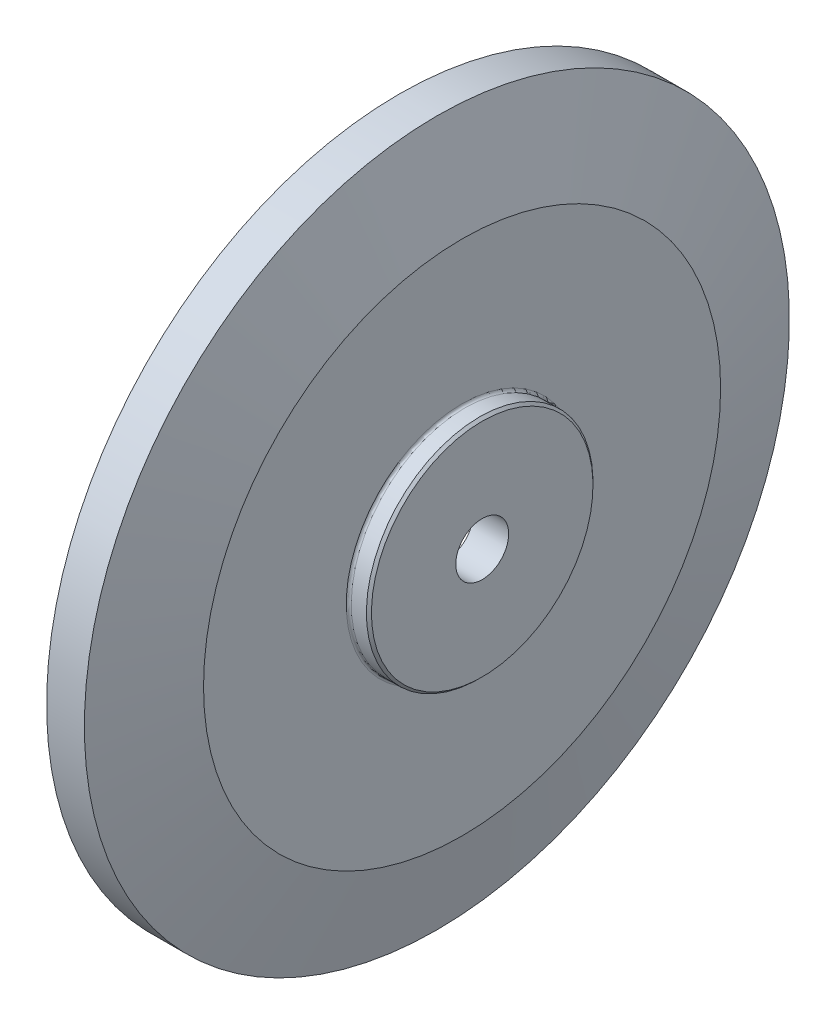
ISO-10303-21;
HEADER;
FILE_DESCRIPTION(('STEP AP214'),'2;1');
FILE_NAME('part.step','',(''),(''),'','','');
FILE_SCHEMA(('AUTOMOTIVE_DESIGN { 1 0 10303 214 1 1 1 1 }'));
ENDSEC;
DATA;
#1=APPLICATION_CONTEXT('core data for automotive mechanical design processes');
#2=APPLICATION_PROTOCOL_DEFINITION('international standard','automotive_design',2000,#1);
#3=PRODUCT_CONTEXT('',#1,'mechanical');
#4=PRODUCT('Part','Part','',(#3));
#5=PRODUCT_RELATED_PRODUCT_CATEGORY('part','',(#4));
#6=PRODUCT_DEFINITION_FORMATION('','',#4);
#7=PRODUCT_DEFINITION_CONTEXT('part definition',#1,'design');
#8=PRODUCT_DEFINITION('design','',#6,#7);
#9=PRODUCT_DEFINITION_SHAPE('','',#8);
#10=(LENGTH_UNIT() NAMED_UNIT(*) SI_UNIT(.MILLI.,.METRE.));
#11=(NAMED_UNIT(*) PLANE_ANGLE_UNIT() SI_UNIT($,.RADIAN.));
#12=(NAMED_UNIT(*) SI_UNIT($,.STERADIAN.) SOLID_ANGLE_UNIT());
#13=UNCERTAINTY_MEASURE_WITH_UNIT(LENGTH_MEASURE(1.E-05),#10,'distance_accuracy_value','');
#14=(GEOMETRIC_REPRESENTATION_CONTEXT(3) GLOBAL_UNCERTAINTY_ASSIGNED_CONTEXT((#13)) GLOBAL_UNIT_ASSIGNED_CONTEXT((#10,
#11,#12)) REPRESENTATION_CONTEXT('',''));
#15=CARTESIAN_POINT('',(0.,0.,0.));
#16=DIRECTION('',(0.,0.,1.));
#17=DIRECTION('',(1.,0.,0.));
#18=AXIS2_PLACEMENT_3D('',#15,#16,#17);
#19=CARTESIAN_POINT('',(0.,0.,0.));
#20=DIRECTION('',(1.,0.,0.));
#21=DIRECTION('',(0.,1.,0.));
#22=AXIS2_PLACEMENT_3D('',#19,#20,#21);
#23=CYLINDRICAL_SURFACE('',#22,140.);
#24=CARTESIAN_POINT('',(-16.2471760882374,0.,0.));
#25=DIRECTION('',(1.,0.,0.));
#26=DIRECTION('',(0.,1.,0.));
#27=AXIS2_PLACEMENT_3D('',#24,#25,#26);
#28=CIRCLE('',#27,140.);
#29=CARTESIAN_POINT('',(-16.2471760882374,140.,0.));
#30=VERTEX_POINT('',#29);
#31=EDGE_CURVE('E63',#30,#30,#28,.F.);
#32=ORIENTED_EDGE('',*,*,#31,.T.);
#33=EDGE_LOOP('',(#32));
#34=FACE_BOUND('',#33,.T.);
#35=CARTESIAN_POINT('',(-31.2471760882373,0.,0.));
#36=DIRECTION('',(1.,0.,0.));
#37=DIRECTION('',(0.,1.,0.));
#38=AXIS2_PLACEMENT_3D('',#35,#36,#37);
#39=CIRCLE('',#38,140.);
#40=CARTESIAN_POINT('',(-31.2471760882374,140.,0.));
#41=VERTEX_POINT('',#40);
#42=EDGE_CURVE('E69',#41,#41,#39,.T.);
#43=ORIENTED_EDGE('',*,*,#42,.T.);
#44=EDGE_LOOP('',(#43));
#45=FACE_BOUND('',#44,.T.);
#46=ADVANCED_FACE('F37',(#34,#45),#23,.T.);
#47=CARTESIAN_POINT('',(-31.2471760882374,140.,0.));
#48=DIRECTION('',(-1.,0.,0.));
#49=DIRECTION('',(0.,-1.,0.));
#50=AXIS2_PLACEMENT_3D('',#47,#48,#49);
#51=PLANE('',#50);
#52=CARTESIAN_POINT('',(-31.2471760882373,0.,0.));
#53=DIRECTION('',(1.,0.,0.));
#54=DIRECTION('',(0.,1.,0.));
#55=AXIS2_PLACEMENT_3D('',#52,#53,#54);
#56=CIRCLE('',#55,100.);
#57=CARTESIAN_POINT('',(-31.2471760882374,100.,0.));
#58=VERTEX_POINT('',#57);
#59=EDGE_CURVE('E72',#58,#58,#56,.T.);
#60=ORIENTED_EDGE('',*,*,#59,.T.);
#61=EDGE_LOOP('',(#60));
#62=FACE_BOUND('',#61,.T.);
#63=ORIENTED_EDGE('',*,*,#42,.F.);
#64=EDGE_LOOP('',(#63));
#65=FACE_BOUND('',#64,.T.);
#66=ADVANCED_FACE('F120',(#62,#65),#51,.T.);
#67=CARTESIAN_POINT('',(0.,0.,0.));
#68=DIRECTION('',(1.,0.,0.));
#69=DIRECTION('',(0.,1.,0.));
#70=AXIS2_PLACEMENT_3D('',#67,#68,#69);
#71=CYLINDRICAL_SURFACE('',#70,100.);
#72=CARTESIAN_POINT('',(-29.2471760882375,0.,0.));
#73=DIRECTION('',(-1.,0.,0.));
#74=DIRECTION('',(0.,-1.,0.));
#75=AXIS2_PLACEMENT_3D('',#72,#73,#74);
#76=CIRCLE('',#75,100.);
#77=CARTESIAN_POINT('',(-29.2471760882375,-100.,0.));
#78=VERTEX_POINT('',#77);
#79=EDGE_CURVE('E60',#78,#78,#76,.F.);
#80=ORIENTED_EDGE('',*,*,#79,.T.);
#81=EDGE_LOOP('',(#80));
#82=FACE_BOUND('',#81,.T.);
#83=ORIENTED_EDGE('',*,*,#59,.F.);
#84=EDGE_LOOP('',(#83));
#85=FACE_BOUND('',#84,.T.);
#86=ADVANCED_FACE('F106',(#82,#85),#71,.F.);
#87=CARTESIAN_POINT('',(-24.2471760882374,100.,0.));
#88=DIRECTION('',(-1.,0.,0.));
#89=DIRECTION('',(0.,-1.,0.));
#90=AXIS2_PLACEMENT_3D('',#87,#88,#89);
#91=PLANE('',#90);
#92=CARTESIAN_POINT('',(-24.2471760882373,0.,0.));
#93=DIRECTION('',(-1.,0.,0.));
#94=DIRECTION('',(0.,-1.,0.));
#95=AXIS2_PLACEMENT_3D('',#92,#93,#94);
#96=CIRCLE('',#95,30.);
#97=CARTESIAN_POINT('',(-24.2471760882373,-30.,0.));
#98=VERTEX_POINT('',#97);
#99=EDGE_CURVE('E76',#98,#98,#96,.T.);
#100=ORIENTED_EDGE('',*,*,#99,.F.);
#101=EDGE_LOOP('',(#100));
#102=FACE_BOUND('',#101,.T.);
#103=CARTESIAN_POINT('',(-24.2471760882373,0.,0.));
#104=DIRECTION('',(-1.,0.,0.));
#105=DIRECTION('',(0.,-1.,0.));
#106=AXIS2_PLACEMENT_3D('',#103,#104,#105);
#107=CIRCLE('',#106,94.9999999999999);
#108=CARTESIAN_POINT('',(-24.2471760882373,-94.9999999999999,0.));
#109=VERTEX_POINT('',#108);
#110=EDGE_CURVE('E57',#109,#109,#107,.T.);
#111=ORIENTED_EDGE('',*,*,#110,.T.);
#112=EDGE_LOOP('',(#111));
#113=FACE_BOUND('',#112,.T.);
#114=ADVANCED_FACE('F102',(#102,#113),#91,.T.);
#115=CARTESIAN_POINT('',(1.75282391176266,0.,0.));
#116=DIRECTION('',(1.,0.,0.));
#117=DIRECTION('',(0.,1.,0.));
#118=AXIS2_PLACEMENT_3D('',#115,#116,#117);
#119=PLANE('',#118);
#120=CARTESIAN_POINT('',(1.75282391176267,0.,0.));
#121=DIRECTION('',(-1.,0.,0.));
#122=DIRECTION('',(0.,0.,1.));
#123=AXIS2_PLACEMENT_3D('',#120,#121,#122);
#124=CIRCLE('',#123,10.5);
#125=CARTESIAN_POINT('',(1.75282391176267,0.,10.5));
#126=VERTEX_POINT('',#125);
#127=EDGE_CURVE('E79',#126,#126,#124,.T.);
#128=ORIENTED_EDGE('',*,*,#127,.T.);
#129=EDGE_LOOP('',(#128));
#130=FACE_BOUND('',#129,.T.);
#131=CARTESIAN_POINT('',(1.75282391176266,0.,0.));
#132=DIRECTION('',(1.,0.,0.));
#133=DIRECTION('',(0.,1.,0.));
#134=AXIS2_PLACEMENT_3D('',#131,#132,#133);
#135=CIRCLE('',#134,44.);
#136=CARTESIAN_POINT('',(1.75282391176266,44.,0.));
#137=VERTEX_POINT('',#136);
#138=EDGE_CURVE('E44',#137,#137,#135,.T.);
#139=ORIENTED_EDGE('',*,*,#138,.T.);
#140=EDGE_LOOP('',(#139));
#141=FACE_BOUND('',#140,.T.);
#142=ADVANCED_FACE('F105',(#130,#141),#119,.T.);
#143=CARTESIAN_POINT('',(0.,0.,0.));
#144=DIRECTION('',(1.,0.,0.));
#145=DIRECTION('',(0.,1.,0.));
#146=AXIS2_PLACEMENT_3D('',#143,#144,#145);
#147=CYLINDRICAL_SURFACE('',#146,45.);
#148=CARTESIAN_POINT('',(0.752823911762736,0.,0.));
#149=DIRECTION('',(1.,0.,0.));
#150=DIRECTION('',(0.,1.,0.));
#151=AXIS2_PLACEMENT_3D('',#148,#149,#150);
#152=CIRCLE('',#151,45.);
#153=CARTESIAN_POINT('',(0.752823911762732,45.,0.));
#154=VERTEX_POINT('',#153);
#155=EDGE_CURVE('E10',#154,#154,#152,.F.);
#156=ORIENTED_EDGE('',*,*,#155,.T.);
#157=EDGE_LOOP('',(#156));
#158=FACE_BOUND('',#157,.T.);
#159=CARTESIAN_POINT('',(-5.24717608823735,0.,0.));
#160=DIRECTION('',(1.,0.,0.));
#161=DIRECTION('',(0.,1.,0.));
#162=AXIS2_PLACEMENT_3D('',#159,#160,#161);
#163=CIRCLE('',#162,45.);
#164=CARTESIAN_POINT('',(-5.24717608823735,45.,0.));
#165=VERTEX_POINT('',#164);
#166=EDGE_CURVE('E52',#165,#165,#163,.T.);
#167=ORIENTED_EDGE('',*,*,#166,.T.);
#168=EDGE_LOOP('',(#167));
#169=FACE_BOUND('',#168,.T.);
#170=ADVANCED_FACE('F148',(#158,#169),#147,.T.);
#171=CARTESIAN_POINT('',(-6.24717608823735,45.,0.));
#172=DIRECTION('',(1.,0.,0.));
#173=DIRECTION('',(0.,1.,0.));
#174=AXIS2_PLACEMENT_3D('',#171,#172,#173);
#175=PLANE('',#174);
#176=CARTESIAN_POINT('',(-6.24717608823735,0.,0.));
#177=DIRECTION('',(1.,0.,0.));
#178=DIRECTION('',(0.,1.,0.));
#179=AXIS2_PLACEMENT_3D('',#176,#177,#178);
#180=CIRCLE('',#179,46.);
#181=CARTESIAN_POINT('',(-6.24717608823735,46.,0.));
#182=VERTEX_POINT('',#181);
#183=EDGE_CURVE('E48',#182,#182,#180,.F.);
#184=ORIENTED_EDGE('',*,*,#183,.T.);
#185=EDGE_LOOP('',(#184));
#186=FACE_BOUND('',#185,.T.);
#187=CARTESIAN_POINT('',(-6.24717608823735,0.,0.));
#188=DIRECTION('',(1.,0.,0.));
#189=DIRECTION('',(0.,1.,0.));
#190=AXIS2_PLACEMENT_3D('',#187,#188,#189);
#191=CIRCLE('',#190,102.679491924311);
#192=CARTESIAN_POINT('',(-6.24717608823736,102.679491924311,0.));
#193=VERTEX_POINT('',#192);
#194=EDGE_CURVE('E66',#193,#193,#191,.T.);
#195=ORIENTED_EDGE('',*,*,#194,.T.);
#196=EDGE_LOOP('',(#195));
#197=FACE_BOUND('',#196,.T.);
#198=ADVANCED_FACE('F136',(#186,#197),#175,.T.);
#199=CARTESIAN_POINT('',(-6.24717608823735,0.,0.));
#200=DIRECTION('',(-1.,0.,0.));
#201=DIRECTION('',(0.,-1.,0.));
#202=AXIS2_PLACEMENT_3D('',#199,#200,#201);
#203=CONICAL_SURFACE('',#202,102.679491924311,1.30899693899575);
#204=ORIENTED_EDGE('',*,*,#31,.F.);
#205=EDGE_LOOP('',(#204));
#206=FACE_BOUND('',#205,.T.);
#207=ORIENTED_EDGE('',*,*,#194,.F.);
#208=EDGE_LOOP('',(#207));
#209=FACE_BOUND('',#208,.T.);
#210=ADVANCED_FACE('F114',(#206,#209),#203,.T.);
#211=CARTESIAN_POINT('',(-29.2471760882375,0.,0.));
#212=DIRECTION('',(-1.,0.,0.));
#213=DIRECTION('',(0.,-1.,0.));
#214=AXIS2_PLACEMENT_3D('',#211,#212,#213);
#215=CONICAL_SURFACE('',#214,100.,0.785398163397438);
#216=CARTESIAN_POINT('',(-24.2471760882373,-94.9999999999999,0.));
#217=CARTESIAN_POINT('',(-24.2992594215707,-95.0520833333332,0.));
#218=CARTESIAN_POINT('',(-24.351342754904,-95.1041666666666,0.));
#219=CARTESIAN_POINT('',(-24.4555094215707,-95.2083333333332,0.));
#220=CARTESIAN_POINT('',(-24.507592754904,-95.2604166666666,0.));
#221=CARTESIAN_POINT('',(-24.6117594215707,-95.3645833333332,0.));
#222=CARTESIAN_POINT('',(-24.663842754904,-95.4166666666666,0.));
#223=CARTESIAN_POINT('',(-24.7680094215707,-95.5208333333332,0.));
#224=CARTESIAN_POINT('',(-24.820092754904,-95.5729166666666,0.));
#225=CARTESIAN_POINT('',(-24.9242594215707,-95.6770833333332,0.));
#226=CARTESIAN_POINT('',(-24.976342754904,-95.7291666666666,0.));
#227=CARTESIAN_POINT('',(-25.0805094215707,-95.8333333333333,0.));
#228=CARTESIAN_POINT('',(-25.132592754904,-95.8854166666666,0.));
#229=CARTESIAN_POINT('',(-25.2367594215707,-95.9895833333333,0.));
#230=CARTESIAN_POINT('',(-25.288842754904,-96.0416666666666,0.));
#231=CARTESIAN_POINT('',(-25.3930094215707,-96.1458333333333,0.));
#232=CARTESIAN_POINT('',(-25.445092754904,-96.1979166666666,0.));
#233=CARTESIAN_POINT('',(-25.5492594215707,-96.3020833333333,0.));
#234=CARTESIAN_POINT('',(-25.6013427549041,-96.3541666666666,0.));
#235=CARTESIAN_POINT('',(-25.7055094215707,-96.4583333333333,0.));
#236=CARTESIAN_POINT('',(-25.7575927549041,-96.5104166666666,0.));
#237=CARTESIAN_POINT('',(-25.8617594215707,-96.6145833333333,0.));
#238=CARTESIAN_POINT('',(-25.9138427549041,-96.6666666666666,0.));
#239=CARTESIAN_POINT('',(-26.0180094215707,-96.7708333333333,0.));
#240=CARTESIAN_POINT('',(-26.0700927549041,-96.8229166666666,0.));
#241=CARTESIAN_POINT('',(-26.1742594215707,-96.9270833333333,0.));
#242=CARTESIAN_POINT('',(-26.2263427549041,-96.9791666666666,0.));
#243=CARTESIAN_POINT('',(-26.3305094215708,-97.0833333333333,0.));
#244=CARTESIAN_POINT('',(-26.3825927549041,-97.1354166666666,0.));
#245=CARTESIAN_POINT('',(-26.4867594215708,-97.2395833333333,0.));
#246=CARTESIAN_POINT('',(-26.5388427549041,-97.2916666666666,0.));
#247=CARTESIAN_POINT('',(-26.6430094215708,-97.3958333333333,0.));
#248=CARTESIAN_POINT('',(-26.6950927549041,-97.4479166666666,0.));
#249=CARTESIAN_POINT('',(-26.7992594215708,-97.5520833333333,0.));
#250=CARTESIAN_POINT('',(-26.8513427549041,-97.6041666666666,0.));
#251=CARTESIAN_POINT('',(-26.9555094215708,-97.7083333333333,0.));
#252=CARTESIAN_POINT('',(-27.0075927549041,-97.7604166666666,0.));
#253=CARTESIAN_POINT('',(-27.1117594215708,-97.8645833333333,0.));
#254=CARTESIAN_POINT('',(-27.1638427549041,-97.9166666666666,0.));
#255=CARTESIAN_POINT('',(-27.2680094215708,-98.0208333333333,0.));
#256=CARTESIAN_POINT('',(-27.3200927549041,-98.0729166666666,0.));
#257=CARTESIAN_POINT('',(-27.4242594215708,-98.1770833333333,0.));
#258=CARTESIAN_POINT('',(-27.4763427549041,-98.2291666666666,0.));
#259=CARTESIAN_POINT('',(-27.5805094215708,-98.3333333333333,0.));
#260=CARTESIAN_POINT('',(-27.6325927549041,-98.3854166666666,0.));
#261=CARTESIAN_POINT('',(-27.7367594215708,-98.4895833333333,0.));
#262=CARTESIAN_POINT('',(-27.7888427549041,-98.5416666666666,0.));
#263=CARTESIAN_POINT('',(-27.8930094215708,-98.6458333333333,0.));
#264=CARTESIAN_POINT('',(-27.9450927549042,-98.6979166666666,0.));
#265=CARTESIAN_POINT('',(-28.0492594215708,-98.8020833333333,0.));
#266=CARTESIAN_POINT('',(-28.1013427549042,-98.8541666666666,0.));
#267=CARTESIAN_POINT('',(-28.2055094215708,-98.9583333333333,0.));
#268=CARTESIAN_POINT('',(-28.2575927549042,-99.0104166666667,0.));
#269=CARTESIAN_POINT('',(-28.3617594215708,-99.1145833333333,0.));
#270=CARTESIAN_POINT('',(-28.4138427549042,-99.1666666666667,0.));
#271=CARTESIAN_POINT('',(-28.5180094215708,-99.2708333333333,0.));
#272=CARTESIAN_POINT('',(-28.5700927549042,-99.3229166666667,0.));
#273=CARTESIAN_POINT('',(-28.6742594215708,-99.4270833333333,0.));
#274=CARTESIAN_POINT('',(-28.7263427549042,-99.4791666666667,0.));
#275=CARTESIAN_POINT('',(-28.8305094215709,-99.5833333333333,0.));
#276=CARTESIAN_POINT('',(-28.8825927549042,-99.6354166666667,0.));
#277=CARTESIAN_POINT('',(-28.9867594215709,-99.7395833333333,0.));
#278=CARTESIAN_POINT('',(-29.0388427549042,-99.7916666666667,0.));
#279=CARTESIAN_POINT('',(-29.1430094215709,-99.8958333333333,0.));
#280=CARTESIAN_POINT('',(-29.1950927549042,-99.9479166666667,0.));
#281=CARTESIAN_POINT('',(-29.2471760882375,-100.,0.));
#282=B_SPLINE_CURVE_WITH_KNOTS('',3,(#216,#217,#218,#219,#220,#221,#222,#223,#224,#225,#226,
#227,#228,#229,#230,#231,#232,#233,#234,#235,#236,#237,#238,#239,#240,#241,#242,#243,#244,#245,
#246,#247,#248,#249,#250,#251,#252,#253,#254,#255,#256,#257,#258,#259,#260,#261,#262,#263,#264,
#265,#266,#267,#268,#269,#270,#271,#272,#273,#274,#275,#276,#277,#278,#279,#280,#281),
.UNSPECIFIED.,.F.,.F.,(4,2,2,2,2,2,2,2,2,2,2,2,2,2,2,2,2,2,2,2,2,2,2,2,2,2,2,2,2,2,2,2,4),(0.,
0.220970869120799,0.441941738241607,0.662912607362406,0.883883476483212,1.10485434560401,
1.32582521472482,1.54679608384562,1.76776695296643,1.98873782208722,2.20970869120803,
2.43067956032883,2.65165042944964,2.87262129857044,3.09359216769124,3.31456303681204,
3.53553390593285,3.75650477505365,3.97747564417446,4.19844651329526,4.41941738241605,
4.64038825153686,4.86135912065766,5.08232998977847,5.30330085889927,5.52427172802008,
5.74524259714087,5.96621346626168,6.18718433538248,6.40815520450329,6.62912607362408,
6.85009694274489,7.07106781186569),.UNSPECIFIED.);
#283=EDGE_CURVE('BSEAM110',#109,#78,#282,.T.);
#284=ORIENTED_EDGE('',*,*,#110,.F.);
#285=ORIENTED_EDGE('',*,*,#79,.F.);
#286=ORIENTED_EDGE('',*,*,#283,.T.);
#287=ORIENTED_EDGE('',*,*,#283,.F.);
#288=EDGE_LOOP('',(#284,#286,#285,#287));
#289=FACE_BOUND('',#288,.T.);
#290=ADVANCED_FACE('F110',(#289),#215,.F.);
#291=CARTESIAN_POINT('',(-5.24717608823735,0.,0.));
#292=DIRECTION('',(1.,0.,0.));
#293=DIRECTION('',(0.,1.,0.));
#294=AXIS2_PLACEMENT_3D('',#291,#292,#293);
#295=TOROIDAL_SURFACE('',#294,46.,1.);
#296=ORIENTED_EDGE('',*,*,#183,.F.);
#297=EDGE_LOOP('',(#296));
#298=FACE_BOUND('',#297,.T.);
#299=ORIENTED_EDGE('',*,*,#166,.F.);
#300=EDGE_LOOP('',(#299));
#301=FACE_BOUND('',#300,.T.);
#302=ADVANCED_FACE('F113',(#298,#301),#295,.F.);
#303=CARTESIAN_POINT('',(1.75282391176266,0.,0.));
#304=DIRECTION('',(-1.,0.,0.));
#305=DIRECTION('',(0.,-1.,0.));
#306=AXIS2_PLACEMENT_3D('',#303,#304,#305);
#307=CONICAL_SURFACE('',#306,44.,0.785398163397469);
#308=ORIENTED_EDGE('',*,*,#155,.F.);
#309=EDGE_LOOP('',(#308));
#310=FACE_BOUND('',#309,.T.);
#311=ORIENTED_EDGE('',*,*,#138,.F.);
#312=EDGE_LOOP('',(#311));
#313=FACE_BOUND('',#312,.T.);
#314=ADVANCED_FACE('F39',(#310,#313),#307,.T.);
#315=CARTESIAN_POINT('',(-12.2471760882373,0.,0.));
#316=DIRECTION('',(-1.,0.,0.));
#317=DIRECTION('',(0.,-1.,0.));
#318=AXIS2_PLACEMENT_3D('',#315,#316,#317);
#319=CYLINDRICAL_SURFACE('',#318,30.);
#320=CARTESIAN_POINT('',(-12.2471760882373,0.,0.));
#321=DIRECTION('',(-1.,0.,0.));
#322=DIRECTION('',(0.,-1.,0.));
#323=AXIS2_PLACEMENT_3D('',#320,#321,#322);
#324=CIRCLE('',#323,30.);
#325=CARTESIAN_POINT('',(-12.2471760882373,-30.,0.));
#326=VERTEX_POINT('',#325);
#327=EDGE_CURVE('E75',#326,#326,#324,.T.);
#328=ORIENTED_EDGE('',*,*,#327,.F.);
#329=EDGE_LOOP('',(#328));
#330=FACE_BOUND('',#329,.T.);
#331=ORIENTED_EDGE('',*,*,#99,.T.);
#332=EDGE_LOOP('',(#331));
#333=FACE_BOUND('',#332,.T.);
#334=ADVANCED_FACE('F93',(#330,#333),#319,.F.);
#335=CARTESIAN_POINT('',(-12.2471760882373,0.,0.));
#336=DIRECTION('',(-1.,0.,0.));
#337=DIRECTION('',(0.,-1.,0.));
#338=AXIS2_PLACEMENT_3D('',#335,#336,#337);
#339=PLANE('',#338);
#340=CARTESIAN_POINT('',(-12.2471760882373,0.,0.));
#341=DIRECTION('',(-1.,0.,0.));
#342=DIRECTION('',(0.,0.,1.));
#343=AXIS2_PLACEMENT_3D('',#340,#341,#342);
#344=CIRCLE('',#343,10.5);
#345=CARTESIAN_POINT('',(-12.2471760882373,0.,10.5));
#346=VERTEX_POINT('',#345);
#347=EDGE_CURVE('E84',#346,#346,#344,.T.);
#348=ORIENTED_EDGE('',*,*,#347,.F.);
#349=EDGE_LOOP('',(#348));
#350=FACE_BOUND('',#349,.T.);
#351=ORIENTED_EDGE('',*,*,#327,.T.);
#352=EDGE_LOOP('',(#351));
#353=FACE_BOUND('',#352,.T.);
#354=ADVANCED_FACE('F90',(#350,#353),#339,.T.);
#355=CARTESIAN_POINT('',(-12.2471760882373,0.,0.));
#356=DIRECTION('',(-1.,0.,0.));
#357=DIRECTION('',(0.,0.,1.));
#358=AXIS2_PLACEMENT_3D('',#355,#356,#357);
#359=CYLINDRICAL_SURFACE('',#358,10.5);
#360=ORIENTED_EDGE('',*,*,#127,.F.);
#361=EDGE_LOOP('',(#360));
#362=FACE_BOUND('',#361,.T.);
#363=ORIENTED_EDGE('',*,*,#347,.T.);
#364=EDGE_LOOP('',(#363));
#365=FACE_BOUND('',#364,.T.);
#366=ADVANCED_FACE('F88',(#362,#365),#359,.F.);
#367=CLOSED_SHELL('',(#46,#66,#86,#114,#142,#170,#198,#210,#290,#302,#314,#334,#354,#366));
#368=MANIFOLD_SOLID_BREP('B2',#367);
#369=ADVANCED_BREP_SHAPE_REPRESENTATION('',(#18,#368),#14);
#370=SHAPE_DEFINITION_REPRESENTATION(#9,#369);
ENDSEC;
END-ISO-10303-21;
